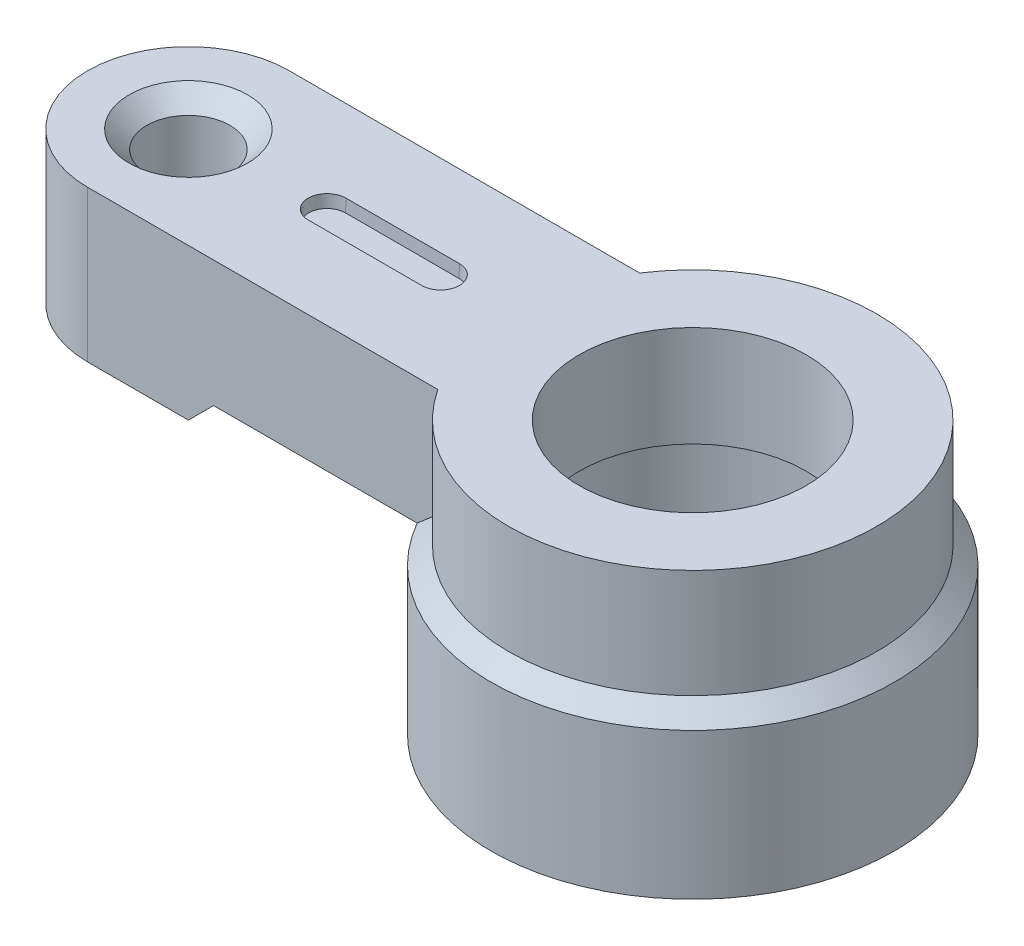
ISO-10303-21;
HEADER;
FILE_DESCRIPTION(('STEP AP214'),'2;1');
FILE_NAME('part.step','',(''),(''),'','','');
FILE_SCHEMA(('AUTOMOTIVE_DESIGN { 1 0 10303 214 1 1 1 1 }'));
ENDSEC;
DATA;
#1=APPLICATION_CONTEXT('core data for automotive mechanical design processes');
#2=APPLICATION_PROTOCOL_DEFINITION('international standard','automotive_design',2000,#1);
#3=PRODUCT_CONTEXT('',#1,'mechanical');
#4=PRODUCT('Part','Part','',(#3));
#5=PRODUCT_RELATED_PRODUCT_CATEGORY('part','',(#4));
#6=PRODUCT_DEFINITION_FORMATION('','',#4);
#7=PRODUCT_DEFINITION_CONTEXT('part definition',#1,'design');
#8=PRODUCT_DEFINITION('design','',#6,#7);
#9=PRODUCT_DEFINITION_SHAPE('','',#8);
#10=(LENGTH_UNIT() NAMED_UNIT(*) SI_UNIT(.MILLI.,.METRE.));
#11=(NAMED_UNIT(*) PLANE_ANGLE_UNIT() SI_UNIT($,.RADIAN.));
#12=(NAMED_UNIT(*) SI_UNIT($,.STERADIAN.) SOLID_ANGLE_UNIT());
#13=UNCERTAINTY_MEASURE_WITH_UNIT(LENGTH_MEASURE(1.E-05),#10,'distance_accuracy_value','');
#14=(GEOMETRIC_REPRESENTATION_CONTEXT(3) GLOBAL_UNCERTAINTY_ASSIGNED_CONTEXT((#13)) GLOBAL_UNIT_ASSIGNED_CONTEXT((#10,
#11,#12)) REPRESENTATION_CONTEXT('',''));
#15=CARTESIAN_POINT('',(0.,0.,0.));
#16=DIRECTION('',(0.,0.,1.));
#17=DIRECTION('',(1.,0.,0.));
#18=AXIS2_PLACEMENT_3D('',#15,#16,#17);
#19=CARTESIAN_POINT('',(0.,10.8,0.));
#20=DIRECTION('',(0.,1.,0.));
#21=DIRECTION('',(0.,0.,1.));
#22=AXIS2_PLACEMENT_3D('',#19,#20,#21);
#23=PLANE('',#22);
#24=CARTESIAN_POINT('',(-20.,10.8,0.));
#25=DIRECTION('',(0.,-1.,0.));
#26=DIRECTION('',(0.,0.,-1.));
#27=AXIS2_PLACEMENT_3D('',#24,#25,#26);
#28=CIRCLE('',#27,2.35);
#29=CARTESIAN_POINT('',(-20.,10.8,-2.35));
#30=VERTEX_POINT('',#29);
#31=EDGE_CURVE('E306',#30,#30,#28,.T.);
#32=ORIENTED_EDGE('',*,*,#31,.F.);
#33=EDGE_LOOP('',(#32));
#34=FACE_BOUND('',#33,.T.);
#35=DIRECTION('',(-1.,0.,0.));
#36=VECTOR('',#35,1.);
#37=CARTESIAN_POINT('',(-6.10655385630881,10.8,-4.));
#38=LINE('',#37,#36);
#39=CARTESIAN_POINT('',(-16.,10.8,-4.));
#40=VERTEX_POINT('',#39);
#41=CARTESIAN_POINT('',(-20.,10.8,-4.));
#42=VERTEX_POINT('',#41);
#43=EDGE_CURVE('E224',#40,#42,#38,.T.);
#44=ORIENTED_EDGE('',*,*,#43,.F.);
#45=DIRECTION('',(0.,0.,1.));
#46=VECTOR('',#45,1.);
#47=CARTESIAN_POINT('',(-16.,10.8,-8.));
#48=LINE('',#47,#46);
#49=CARTESIAN_POINT('',(-16.,10.8,4.));
#50=VERTEX_POINT('',#49);
#51=EDGE_CURVE('E222',#40,#50,#48,.T.);
#52=ORIENTED_EDGE('',*,*,#51,.T.);
#53=DIRECTION('',(1.,0.,0.));
#54=VECTOR('',#53,1.);
#55=CARTESIAN_POINT('',(-6.10655385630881,10.8,4.));
#56=LINE('',#55,#54);
#57=CARTESIAN_POINT('',(-20.,10.8,4.));
#58=VERTEX_POINT('',#57);
#59=EDGE_CURVE('E233',#58,#50,#56,.T.);
#60=ORIENTED_EDGE('',*,*,#59,.F.);
#61=CARTESIAN_POINT('',(-20.,10.8,0.));
#62=DIRECTION('',(0.,1.,0.));
#63=DIRECTION('',(0.,0.,1.));
#64=AXIS2_PLACEMENT_3D('',#61,#62,#63);
#65=CIRCLE('',#64,4.);
#66=EDGE_CURVE('E230',#42,#58,#65,.T.);
#67=ORIENTED_EDGE('',*,*,#66,.F.);
#68=EDGE_LOOP('',(#44,#52,#60,#67));
#69=FACE_BOUND('',#68,.T.);
#70=ADVANCED_FACE('F17',(#34,#69),#23,.F.);
#71=CARTESIAN_POINT('',(7.3,16.8,0.));
#72=DIRECTION('',(0.,1.,0.));
#73=DIRECTION('',(0.,0.,1.));
#74=AXIS2_PLACEMENT_3D('',#71,#72,#73);
#75=PLANE('',#74);
#76=CARTESIAN_POINT('',(-20.,16.8,0.));
#77=DIRECTION('',(0.,-1.,0.));
#78=DIRECTION('',(0.,0.,-1.));
#79=AXIS2_PLACEMENT_3D('',#76,#77,#78);
#80=CIRCLE('',#79,2.35);
#81=CARTESIAN_POINT('',(-20.,16.8,-2.35));
#82=VERTEX_POINT('',#81);
#83=EDGE_CURVE('E289',#82,#82,#80,.T.);
#84=ORIENTED_EDGE('',*,*,#83,.T.);
#85=EDGE_LOOP('',(#84));
#86=FACE_BOUND('',#85,.T.);
#87=CARTESIAN_POINT('',(0.,16.8,0.));
#88=DIRECTION('',(0.,-1.,0.));
#89=DIRECTION('',(0.,0.,-1.));
#90=AXIS2_PLACEMENT_3D('',#87,#88,#89);
#91=CIRCLE('',#90,4.5);
#92=CARTESIAN_POINT('',(0.,16.8,-4.5));
#93=VERTEX_POINT('',#92);
#94=EDGE_CURVE('E254',#93,#93,#91,.T.);
#95=ORIENTED_EDGE('',*,*,#94,.T.);
#96=EDGE_LOOP('',(#95));
#97=FACE_BOUND('',#96,.T.);
#98=CARTESIAN_POINT('',(0.,16.8,0.));
#99=DIRECTION('',(0.,-1.,0.));
#100=DIRECTION('',(0.,0.,-1.));
#101=AXIS2_PLACEMENT_3D('',#98,#99,#100);
#102=CIRCLE('',#101,7.3);
#103=CARTESIAN_POINT('',(-6.10655385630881,16.8,-4.));
#104=VERTEX_POINT('',#103);
#105=CARTESIAN_POINT('',(-6.10655385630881,16.8,4.));
#106=VERTEX_POINT('',#105);
#107=EDGE_CURVE('E133',#104,#106,#102,.T.);
#108=ORIENTED_EDGE('',*,*,#107,.F.);
#109=DIRECTION('',(-1.,0.,0.));
#110=VECTOR('',#109,1.);
#111=CARTESIAN_POINT('',(-6.10655385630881,16.8,-4.));
#112=LINE('',#111,#110);
#113=CARTESIAN_POINT('',(-20.,16.8,-4.));
#114=VERTEX_POINT('',#113);
#115=EDGE_CURVE('E243',#104,#114,#112,.T.);
#116=ORIENTED_EDGE('',*,*,#115,.T.);
#117=CARTESIAN_POINT('',(-20.,16.8,0.));
#118=DIRECTION('',(0.,1.,0.));
#119=DIRECTION('',(0.,0.,1.));
#120=AXIS2_PLACEMENT_3D('',#117,#118,#119);
#121=CIRCLE('',#120,4.);
#122=CARTESIAN_POINT('',(-20.,16.8,4.));
#123=VERTEX_POINT('',#122);
#124=EDGE_CURVE('E236',#114,#123,#121,.T.);
#125=ORIENTED_EDGE('',*,*,#124,.T.);
#126=DIRECTION('',(1.,0.,0.));
#127=VECTOR('',#126,1.);
#128=CARTESIAN_POINT('',(-6.10655385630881,16.8,4.));
#129=LINE('',#128,#127);
#130=EDGE_CURVE('E231',#123,#106,#129,.T.);
#131=ORIENTED_EDGE('',*,*,#130,.T.);
#132=EDGE_LOOP('',(#108,#116,#125,#131));
#133=FACE_BOUND('',#132,.T.);
#134=DIRECTION('',(1.,0.,0.));
#135=VECTOR('',#134,1.);
#136=CARTESIAN_POINT('',(-10.,16.8,-0.75));
#137=LINE('',#136,#135);
#138=CARTESIAN_POINT('',(-14.5,16.8,-0.75));
#139=VERTEX_POINT('',#138);
#140=CARTESIAN_POINT('',(-10.,16.8,-0.75));
#141=VERTEX_POINT('',#140);
#142=EDGE_CURVE('E283',#139,#141,#137,.T.);
#143=ORIENTED_EDGE('',*,*,#142,.T.);
#144=CARTESIAN_POINT('',(-10.,16.8,0.));
#145=DIRECTION('',(0.,-1.,0.));
#146=DIRECTION('',(0.,0.,-1.));
#147=AXIS2_PLACEMENT_3D('',#144,#145,#146);
#148=CIRCLE('',#147,0.75);
#149=CARTESIAN_POINT('',(-10.,16.8,0.75));
#150=VERTEX_POINT('',#149);
#151=EDGE_CURVE('E32',#141,#150,#148,.T.);
#152=ORIENTED_EDGE('',*,*,#151,.T.);
#153=DIRECTION('',(-1.,0.,0.));
#154=VECTOR('',#153,1.);
#155=CARTESIAN_POINT('',(-10.,16.8,0.75));
#156=LINE('',#155,#154);
#157=CARTESIAN_POINT('',(-14.5,16.8,0.75));
#158=VERTEX_POINT('',#157);
#159=EDGE_CURVE('E277',#150,#158,#156,.T.);
#160=ORIENTED_EDGE('',*,*,#159,.T.);
#161=CARTESIAN_POINT('',(-14.5,16.8,0.));
#162=DIRECTION('',(0.,-1.,0.));
#163=DIRECTION('',(0.,0.,-1.));
#164=AXIS2_PLACEMENT_3D('',#161,#162,#163);
#165=CIRCLE('',#164,0.75);
#166=EDGE_CURVE('E280',#158,#139,#165,.T.);
#167=ORIENTED_EDGE('',*,*,#166,.T.);
#168=EDGE_LOOP('',(#143,#152,#160,#167));
#169=FACE_BOUND('',#168,.T.);
#170=ADVANCED_FACE('F19',(#86,#97,#133,#169),#75,.T.);
#171=CARTESIAN_POINT('',(0.,6.,0.));
#172=DIRECTION('',(0.,-1.,0.));
#173=DIRECTION('',(0.,0.,-1.));
#174=AXIS2_PLACEMENT_3D('',#171,#172,#173);
#175=CYLINDRICAL_SURFACE('',#174,4.5);
#176=CARTESIAN_POINT('',(0.,12.8,0.));
#177=DIRECTION('',(0.,-1.,0.));
#178=DIRECTION('',(0.,0.,-1.));
#179=AXIS2_PLACEMENT_3D('',#176,#177,#178);
#180=CIRCLE('',#179,4.5);
#181=CARTESIAN_POINT('',(0.,12.8,-4.5));
#182=VERTEX_POINT('',#181);
#183=EDGE_CURVE('E259',#182,#182,#180,.T.);
#184=ORIENTED_EDGE('',*,*,#183,.T.);
#185=EDGE_LOOP('',(#184));
#186=FACE_BOUND('',#185,.T.);
#187=ORIENTED_EDGE('',*,*,#94,.F.);
#188=EDGE_LOOP('',(#187));
#189=FACE_BOUND('',#188,.T.);
#190=ADVANCED_FACE('F176',(#186,#189),#175,.F.);
#191=CARTESIAN_POINT('',(4.5,12.8,0.));
#192=DIRECTION('',(0.,-1.,0.));
#193=DIRECTION('',(0.,0.,-1.));
#194=AXIS2_PLACEMENT_3D('',#191,#192,#193);
#195=PLANE('',#194);
#196=CARTESIAN_POINT('',(0.,12.8,0.));
#197=DIRECTION('',(0.,-1.,0.));
#198=DIRECTION('',(0.,0.,-1.));
#199=AXIS2_PLACEMENT_3D('',#196,#197,#198);
#200=CIRCLE('',#199,5.15);
#201=CARTESIAN_POINT('',(0.,12.8,-5.15));
#202=VERTEX_POINT('',#201);
#203=EDGE_CURVE('E262',#202,#202,#200,.T.);
#204=ORIENTED_EDGE('',*,*,#203,.T.);
#205=EDGE_LOOP('',(#204));
#206=FACE_BOUND('',#205,.T.);
#207=ORIENTED_EDGE('',*,*,#183,.F.);
#208=EDGE_LOOP('',(#207));
#209=FACE_BOUND('',#208,.T.);
#210=ADVANCED_FACE('F321',(#206,#209),#195,.T.);
#211=CARTESIAN_POINT('',(0.,6.,0.));
#212=DIRECTION('',(0.,-1.,0.));
#213=DIRECTION('',(0.,0.,-1.));
#214=AXIS2_PLACEMENT_3D('',#211,#212,#213);
#215=CYLINDRICAL_SURFACE('',#214,5.15);
#216=CARTESIAN_POINT('',(0.,6.,0.));
#217=DIRECTION('',(0.,-1.,0.));
#218=DIRECTION('',(0.,0.,-1.));
#219=AXIS2_PLACEMENT_3D('',#216,#217,#218);
#220=CIRCLE('',#219,5.15);
#221=CARTESIAN_POINT('',(0.,6.,-5.15));
#222=VERTEX_POINT('',#221);
#223=EDGE_CURVE('E265',#222,#222,#220,.T.);
#224=ORIENTED_EDGE('',*,*,#223,.T.);
#225=EDGE_LOOP('',(#224));
#226=FACE_BOUND('',#225,.T.);
#227=ORIENTED_EDGE('',*,*,#203,.F.);
#228=EDGE_LOOP('',(#227));
#229=FACE_BOUND('',#228,.T.);
#230=ADVANCED_FACE('F327',(#226,#229),#215,.F.);
#231=CARTESIAN_POINT('',(5.15,6.,0.));
#232=DIRECTION('',(0.,-1.,0.));
#233=DIRECTION('',(0.,0.,-1.));
#234=AXIS2_PLACEMENT_3D('',#231,#232,#233);
#235=PLANE('',#234);
#236=CARTESIAN_POINT('',(0.,6.,0.));
#237=DIRECTION('',(0.,-1.,0.));
#238=DIRECTION('',(0.,0.,-1.));
#239=AXIS2_PLACEMENT_3D('',#236,#237,#238);
#240=CIRCLE('',#239,8.);
#241=CARTESIAN_POINT('',(0.,6.,-8.));
#242=VERTEX_POINT('',#241);
#243=EDGE_CURVE('E123',#242,#242,#240,.T.);
#244=ORIENTED_EDGE('',*,*,#243,.T.);
#245=EDGE_LOOP('',(#244));
#246=FACE_BOUND('',#245,.T.);
#247=ORIENTED_EDGE('',*,*,#223,.F.);
#248=EDGE_LOOP('',(#247));
#249=FACE_BOUND('',#248,.T.);
#250=ADVANCED_FACE('F333',(#246,#249),#235,.T.);
#251=CARTESIAN_POINT('',(0.,6.,0.));
#252=DIRECTION('',(0.,-1.,0.));
#253=DIRECTION('',(0.,0.,-1.));
#254=AXIS2_PLACEMENT_3D('',#251,#252,#253);
#255=CYLINDRICAL_SURFACE('',#254,8.);
#256=CARTESIAN_POINT('',(0.,11.8,0.));
#257=DIRECTION('',(0.,-1.,0.));
#258=DIRECTION('',(0.,0.,-1.));
#259=AXIS2_PLACEMENT_3D('',#256,#257,#258);
#260=CIRCLE('',#259,8.);
#261=CARTESIAN_POINT('',(-6.92820323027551,11.8,-4.));
#262=VERTEX_POINT('',#261);
#263=CARTESIAN_POINT('',(-6.92820323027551,11.8,4.));
#264=VERTEX_POINT('',#263);
#265=EDGE_CURVE('E117',#262,#264,#260,.T.);
#266=ORIENTED_EDGE('',*,*,#265,.T.);
#267=CARTESIAN_POINT('',(0.,11.8,0.));
#268=DIRECTION('',(0.,1.,0.));
#269=DIRECTION('',(-1.,0.,0.));
#270=AXIS2_PLACEMENT_3D('',#267,#268,#269);
#271=CIRCLE('',#270,8.);
#272=EDGE_CURVE('E106',#264,#262,#271,.F.);
#273=ORIENTED_EDGE('',*,*,#272,.T.);
#274=EDGE_LOOP('',(#266,#273));
#275=FACE_BOUND('',#274,.T.);
#276=ORIENTED_EDGE('',*,*,#243,.F.);
#277=EDGE_LOOP('',(#276));
#278=FACE_BOUND('',#277,.T.);
#279=ADVANCED_FACE('F115',(#275,#278),#255,.T.);
#280=CARTESIAN_POINT('',(0.,11.8,0.));
#281=DIRECTION('',(0.,-1.,0.));
#282=DIRECTION('',(0.,0.,-1.));
#283=AXIS2_PLACEMENT_3D('',#280,#281,#282);
#284=CONICAL_SURFACE('',#283,8.,0.78539816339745);
#285=CARTESIAN_POINT('',(-9.67322054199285,9.33237392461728,4.));
#286=CARTESIAN_POINT('',(-9.42797457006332,9.55896998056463,4.));
#287=CARTESIAN_POINT('',(-9.18213431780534,9.78492888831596,4.));
#288=CARTESIAN_POINT('',(-8.68890503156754,10.235131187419,4.));
#289=CARTESIAN_POINT('',(-8.44151605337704,10.4593746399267,4.));
#290=CARTESIAN_POINT('',(-7.9451174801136,10.9054462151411,4.));
#291=CARTESIAN_POINT('',(-7.69611025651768,11.1272769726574,4.));
#292=CARTESIAN_POINT('',(-7.19562295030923,11.5681757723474,4.));
#293=CARTESIAN_POINT('',(-6.94414268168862,11.7872436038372,4.));
#294=CARTESIAN_POINT('',(-6.4376579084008,12.2219710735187,4.));
#295=CARTESIAN_POINT('',(-6.18264910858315,12.437625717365,4.));
#296=CARTESIAN_POINT('',(-5.66845146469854,12.8638224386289,4.));
#297=CARTESIAN_POINT('',(-5.40926345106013,13.0743655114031,4.));
#298=CARTESIAN_POINT('',(-5.01600401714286,13.3848718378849,4.));
#299=CARTESIAN_POINT('',(-4.88408173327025,13.4875560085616,4.));
#300=CARTESIAN_POINT('',(-4.61854111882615,13.6906952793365,4.));
#301=CARTESIAN_POINT('',(-4.48492288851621,13.7911505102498,4.));
#302=CARTESIAN_POINT('',(-4.21559467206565,13.9894160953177,4.));
#303=CARTESIAN_POINT('',(-4.07988337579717,14.0872246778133,4.));
#304=CARTESIAN_POINT('',(-3.8060375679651,14.2794432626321,4.));
#305=CARTESIAN_POINT('',(-3.66790256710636,14.373852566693,4.));
#306=CARTESIAN_POINT('',(-3.52837489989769,14.4661993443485,4.));
#307=B_SPLINE_CURVE_WITH_KNOTS('',3,(#285,#286,#287,#288,#289,#290,#291,#292,#293,#294,#295,
#296,#297,#298,#299,#300,#301,#302,#303,#304,#305,#306),.UNSPECIFIED.,.F.,.F.,(4,2,2,2,2,2,2,2,
2,2,4),(0.,1.00171470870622,2.00339353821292,3.00383857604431,4.0043594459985,5.00622952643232,
6.00790292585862,6.50940968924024,7.01088694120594,7.51269196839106,8.0145994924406),.UNSPECIFIED.);
#308=CARTESIAN_POINT('',(-6.10655385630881,12.5,4.));
#309=VERTEX_POINT('',#308);
#310=EDGE_CURVE('E122',#264,#309,#307,.T.);
#311=ORIENTED_EDGE('',*,*,#310,.F.);
#312=ORIENTED_EDGE('',*,*,#265,.F.);
#313=CARTESIAN_POINT('',(-3.52837489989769,14.4661993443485,-4.));
#314=CARTESIAN_POINT('',(-3.66790256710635,14.373852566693,-4.));
#315=CARTESIAN_POINT('',(-3.8060375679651,14.2794432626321,-4.));
#316=CARTESIAN_POINT('',(-4.07988337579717,14.0872246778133,-4.));
#317=CARTESIAN_POINT('',(-4.21559467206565,13.9894160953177,-4.));
#318=CARTESIAN_POINT('',(-4.4849228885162,13.7911505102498,-4.));
#319=CARTESIAN_POINT('',(-4.61854111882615,13.6906952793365,-4.));
#320=CARTESIAN_POINT('',(-4.88408173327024,13.4875560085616,-4.));
#321=CARTESIAN_POINT('',(-5.01600401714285,13.3848718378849,-4.));
#322=CARTESIAN_POINT('',(-5.40926345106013,13.0743655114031,-4.));
#323=CARTESIAN_POINT('',(-5.66845146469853,12.8638224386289,-4.));
#324=CARTESIAN_POINT('',(-6.18264910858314,12.437625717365,-4.));
#325=CARTESIAN_POINT('',(-6.4376579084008,12.2219710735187,-4.));
#326=CARTESIAN_POINT('',(-6.94414268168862,11.7872436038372,-4.));
#327=CARTESIAN_POINT('',(-7.19562295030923,11.5681757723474,-4.));
#328=CARTESIAN_POINT('',(-7.69611025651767,11.1272769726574,-4.));
#329=CARTESIAN_POINT('',(-7.94511748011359,10.9054462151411,-4.));
#330=CARTESIAN_POINT('',(-8.44151605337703,10.4593746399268,-4.));
#331=CARTESIAN_POINT('',(-8.68890503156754,10.235131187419,-4.));
#332=CARTESIAN_POINT('',(-9.18213431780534,9.78492888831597,-4.));
#333=CARTESIAN_POINT('',(-9.42797457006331,9.55896998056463,-4.));
#334=CARTESIAN_POINT('',(-9.67322054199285,9.33237392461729,-4.));
#335=B_SPLINE_CURVE_WITH_KNOTS('',3,(#313,#314,#315,#316,#317,#318,#319,#320,#321,#322,#323,
#324,#325,#326,#327,#328,#329,#330,#331,#332,#333,#334),.UNSPECIFIED.,.F.,.F.,(4,2,2,2,2,2,2,2,
2,2,4),(0.,0.501907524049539,1.00371255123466,1.50518980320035,2.00669656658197,
3.00836996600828,4.01024004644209,5.01076091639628,6.01120595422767,7.01288478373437,
8.0145994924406),.UNSPECIFIED.);
#336=CARTESIAN_POINT('',(-6.10655385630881,12.5,-4.));
#337=VERTEX_POINT('',#336);
#338=EDGE_CURVE('E40',#337,#262,#335,.T.);
#339=ORIENTED_EDGE('',*,*,#338,.F.);
#340=CARTESIAN_POINT('',(0.,12.5,0.));
#341=DIRECTION('',(0.,-1.,0.));
#342=DIRECTION('',(0.,0.,-1.));
#343=AXIS2_PLACEMENT_3D('',#340,#341,#342);
#344=CIRCLE('',#343,7.3);
#345=EDGE_CURVE('E124',#337,#309,#344,.T.);
#346=ORIENTED_EDGE('',*,*,#345,.T.);
#347=EDGE_LOOP('',(#311,#312,#339,#346));
#348=FACE_BOUND('',#347,.T.);
#349=ADVANCED_FACE('F120',(#348),#284,.T.);
#350=CARTESIAN_POINT('',(0.,6.,0.));
#351=DIRECTION('',(0.,-1.,0.));
#352=DIRECTION('',(0.,0.,-1.));
#353=AXIS2_PLACEMENT_3D('',#350,#351,#352);
#354=CYLINDRICAL_SURFACE('',#353,7.3);
#355=DIRECTION('',(0.,-1.,0.));
#356=VECTOR('',#355,1.);
#357=CARTESIAN_POINT('',(-6.10655385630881,6.,4.));
#358=LINE('',#357,#356);
#359=EDGE_CURVE('E112',#309,#106,#358,.F.);
#360=ORIENTED_EDGE('',*,*,#359,.F.);
#361=ORIENTED_EDGE('',*,*,#345,.F.);
#362=DIRECTION('',(0.,-1.,0.));
#363=VECTOR('',#362,1.);
#364=CARTESIAN_POINT('',(-6.10655385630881,6.,-4.));
#365=LINE('',#364,#363);
#366=EDGE_CURVE('E130',#104,#337,#365,.T.);
#367=ORIENTED_EDGE('',*,*,#366,.F.);
#368=ORIENTED_EDGE('',*,*,#107,.T.);
#369=EDGE_LOOP('',(#360,#361,#367,#368));
#370=FACE_BOUND('',#369,.T.);
#371=ADVANCED_FACE('F158',(#370),#354,.T.);
#372=CARTESIAN_POINT('',(-6.10655385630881,10.8,4.));
#373=DIRECTION('',(0.,0.,1.));
#374=DIRECTION('',(1.,0.,0.));
#375=AXIS2_PLACEMENT_3D('',#372,#373,#374);
#376=PLANE('',#375);
#377=DIRECTION('',(-1.,0.,0.));
#378=VECTOR('',#377,1.);
#379=CARTESIAN_POINT('',(-15.,11.8,4.));
#380=LINE('',#379,#378);
#381=CARTESIAN_POINT('',(-15.,11.8,4.));
#382=VERTEX_POINT('',#381);
#383=EDGE_CURVE('E118',#264,#382,#380,.T.);
#384=ORIENTED_EDGE('',*,*,#383,.F.);
#385=ORIENTED_EDGE('',*,*,#310,.T.);
#386=ORIENTED_EDGE('',*,*,#359,.T.);
#387=ORIENTED_EDGE('',*,*,#130,.F.);
#388=DIRECTION('',(0.,1.,0.));
#389=VECTOR('',#388,1.);
#390=CARTESIAN_POINT('',(-20.,10.8,4.));
#391=LINE('',#390,#389);
#392=EDGE_CURVE('E131',#58,#123,#391,.T.);
#393=ORIENTED_EDGE('',*,*,#392,.F.);
#394=ORIENTED_EDGE('',*,*,#59,.T.);
#395=DIRECTION('',(-0.707106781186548,-0.707106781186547,0.));
#396=VECTOR('',#395,1.);
#397=CARTESIAN_POINT('',(-16.,10.8,4.));
#398=LINE('',#397,#396);
#399=EDGE_CURVE('E270',#382,#50,#398,.T.);
#400=ORIENTED_EDGE('',*,*,#399,.F.);
#401=EDGE_LOOP('',(#384,#385,#386,#387,#393,#394,#400));
#402=FACE_BOUND('',#401,.T.);
#403=ADVANCED_FACE('F160',(#402),#376,.T.);
#404=CARTESIAN_POINT('',(-20.,10.8,0.));
#405=DIRECTION('',(0.,1.,0.));
#406=DIRECTION('',(0.,0.,1.));
#407=AXIS2_PLACEMENT_3D('',#404,#405,#406);
#408=CYLINDRICAL_SURFACE('',#407,4.);
#409=ORIENTED_EDGE('',*,*,#124,.F.);
#410=DIRECTION('',(0.,1.,0.));
#411=VECTOR('',#410,1.);
#412=CARTESIAN_POINT('',(-20.,10.8,-4.));
#413=LINE('',#412,#411);
#414=EDGE_CURVE('E135',#42,#114,#413,.T.);
#415=ORIENTED_EDGE('',*,*,#414,.F.);
#416=ORIENTED_EDGE('',*,*,#66,.T.);
#417=ORIENTED_EDGE('',*,*,#392,.T.);
#418=EDGE_LOOP('',(#409,#415,#416,#417));
#419=FACE_BOUND('',#418,.T.);
#420=ADVANCED_FACE('F157',(#419),#408,.T.);
#421=CARTESIAN_POINT('',(-6.10655385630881,10.8,-4.));
#422=DIRECTION('',(0.,0.,-1.));
#423=DIRECTION('',(-1.,0.,0.));
#424=AXIS2_PLACEMENT_3D('',#421,#422,#423);
#425=PLANE('',#424);
#426=ORIENTED_EDGE('',*,*,#338,.T.);
#427=DIRECTION('',(1.,0.,0.));
#428=VECTOR('',#427,1.);
#429=CARTESIAN_POINT('',(-6.10655385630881,11.8,-4.));
#430=LINE('',#429,#428);
#431=CARTESIAN_POINT('',(-15.,11.8,-4.));
#432=VERTEX_POINT('',#431);
#433=EDGE_CURVE('E25',#432,#262,#430,.T.);
#434=ORIENTED_EDGE('',*,*,#433,.F.);
#435=DIRECTION('',(0.707106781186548,0.707106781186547,0.));
#436=VECTOR('',#435,1.);
#437=CARTESIAN_POINT('',(-11.0532769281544,15.7467230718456,-4.));
#438=LINE('',#437,#436);
#439=EDGE_CURVE('E11',#40,#432,#438,.T.);
#440=ORIENTED_EDGE('',*,*,#439,.F.);
#441=ORIENTED_EDGE('',*,*,#43,.T.);
#442=ORIENTED_EDGE('',*,*,#414,.T.);
#443=ORIENTED_EDGE('',*,*,#115,.F.);
#444=ORIENTED_EDGE('',*,*,#366,.T.);
#445=EDGE_LOOP('',(#426,#434,#440,#441,#442,#443,#444));
#446=FACE_BOUND('',#445,.T.);
#447=ADVANCED_FACE('F127',(#446),#425,.T.);
#448=CARTESIAN_POINT('',(-20.,16.1,0.));
#449=DIRECTION('',(0.,1.,0.));
#450=DIRECTION('',(0.,0.,1.));
#451=AXIS2_PLACEMENT_3D('',#448,#449,#450);
#452=CONICAL_SURFACE('',#451,1.65,0.785398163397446);
#453=ORIENTED_EDGE('',*,*,#83,.F.);
#454=EDGE_LOOP('',(#453));
#455=FACE_BOUND('',#454,.T.);
#456=CARTESIAN_POINT('',(-20.,16.1,0.));
#457=DIRECTION('',(0.,-1.,0.));
#458=DIRECTION('',(0.,0.,-1.));
#459=AXIS2_PLACEMENT_3D('',#456,#457,#458);
#460=CIRCLE('',#459,1.65);
#461=CARTESIAN_POINT('',(-20.,16.1,-1.65));
#462=VERTEX_POINT('',#461);
#463=EDGE_CURVE('E239',#462,#462,#460,.T.);
#464=ORIENTED_EDGE('',*,*,#463,.T.);
#465=EDGE_LOOP('',(#464));
#466=FACE_BOUND('',#465,.T.);
#467=ADVANCED_FACE('F156',(#455,#466),#452,.F.);
#468=CARTESIAN_POINT('',(-20.,10.8,0.));
#469=DIRECTION('',(0.,-1.,0.));
#470=DIRECTION('',(0.,0.,-1.));
#471=AXIS2_PLACEMENT_3D('',#468,#469,#470);
#472=CYLINDRICAL_SURFACE('',#471,1.65);
#473=ORIENTED_EDGE('',*,*,#463,.F.);
#474=EDGE_LOOP('',(#473));
#475=FACE_BOUND('',#474,.T.);
#476=CARTESIAN_POINT('',(-20.,11.5,0.));
#477=DIRECTION('',(0.,-1.,0.));
#478=DIRECTION('',(0.,0.,-1.));
#479=AXIS2_PLACEMENT_3D('',#476,#477,#478);
#480=CIRCLE('',#479,1.65);
#481=CARTESIAN_POINT('',(-20.,11.5,-1.65));
#482=VERTEX_POINT('',#481);
#483=EDGE_CURVE('E308',#482,#482,#480,.T.);
#484=ORIENTED_EDGE('',*,*,#483,.T.);
#485=EDGE_LOOP('',(#484));
#486=FACE_BOUND('',#485,.T.);
#487=ADVANCED_FACE('F184',(#475,#486),#472,.F.);
#488=CARTESIAN_POINT('',(-20.,10.8,0.));
#489=DIRECTION('',(0.,-1.,0.));
#490=DIRECTION('',(0.,0.,-1.));
#491=AXIS2_PLACEMENT_3D('',#488,#489,#490);
#492=CONICAL_SURFACE('',#491,2.35,0.785398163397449);
#493=ORIENTED_EDGE('',*,*,#483,.F.);
#494=EDGE_LOOP('',(#493));
#495=FACE_BOUND('',#494,.T.);
#496=ORIENTED_EDGE('',*,*,#31,.T.);
#497=EDGE_LOOP('',(#496));
#498=FACE_BOUND('',#497,.T.);
#499=ADVANCED_FACE('F188',(#495,#498),#492,.F.);
#500=CARTESIAN_POINT('',(-10.,16.8,0.));
#501=DIRECTION('',(0.,1.,0.));
#502=DIRECTION('',(0.,0.,-1.));
#503=AXIS2_PLACEMENT_3D('',#500,#501,#502);
#504=CONICAL_SURFACE('',#503,0.75,0.0349065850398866);
#505=ORIENTED_EDGE('',*,*,#151,.F.);
#506=DIRECTION('',(0.,0.999390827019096,-0.034899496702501));
#507=VECTOR('',#506,1.);
#508=CARTESIAN_POINT('',(-10.,16.8,-0.75));
#509=LINE('',#508,#507);
#510=CARTESIAN_POINT('',(-10.,16.3,-0.732539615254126));
#511=VERTEX_POINT('',#510);
#512=EDGE_CURVE('E291',#511,#141,#509,.T.);
#513=ORIENTED_EDGE('',*,*,#512,.F.);
#514=CARTESIAN_POINT('',(-10.,16.3,0.));
#515=DIRECTION('',(0.,-1.,0.));
#516=DIRECTION('',(0.,0.,-1.));
#517=AXIS2_PLACEMENT_3D('',#514,#515,#516);
#518=CIRCLE('',#517,0.732539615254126);
#519=CARTESIAN_POINT('',(-10.,16.3,0.732539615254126));
#520=VERTEX_POINT('',#519);
#521=EDGE_CURVE('E286',#511,#520,#518,.T.);
#522=ORIENTED_EDGE('',*,*,#521,.T.);
#523=DIRECTION('',(0.,0.999390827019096,0.034899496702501));
#524=VECTOR('',#523,1.);
#525=CARTESIAN_POINT('',(-10.,16.8,0.75));
#526=LINE('',#525,#524);
#527=EDGE_CURVE('E287',#520,#150,#526,.T.);
#528=ORIENTED_EDGE('',*,*,#527,.T.);
#529=EDGE_LOOP('',(#505,#513,#522,#528));
#530=FACE_BOUND('',#529,.T.);
#531=ADVANCED_FACE('F192',(#530),#504,.F.);
#532=CARTESIAN_POINT('',(-10.,16.8,0.75));
#533=DIRECTION('',(0.,-0.034899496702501,0.999390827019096));
#534=DIRECTION('',(0.,-0.999390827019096,-0.034899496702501));
#535=AXIS2_PLACEMENT_3D('',#532,#533,#534);
#536=PLANE('',#535);
#537=ORIENTED_EDGE('',*,*,#159,.F.);
#538=ORIENTED_EDGE('',*,*,#527,.F.);
#539=DIRECTION('',(1.,0.,0.));
#540=VECTOR('',#539,1.);
#541=CARTESIAN_POINT('',(-10.,16.3,0.732539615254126));
#542=LINE('',#541,#540);
#543=CARTESIAN_POINT('',(-14.5,16.3,0.732539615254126));
#544=VERTEX_POINT('',#543);
#545=EDGE_CURVE('E299',#520,#544,#542,.F.);
#546=ORIENTED_EDGE('',*,*,#545,.T.);
#547=DIRECTION('',(0.,0.999390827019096,0.034899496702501));
#548=VECTOR('',#547,1.);
#549=CARTESIAN_POINT('',(-14.5,16.8,0.75));
#550=LINE('',#549,#548);
#551=EDGE_CURVE('E290',#544,#158,#550,.T.);
#552=ORIENTED_EDGE('',*,*,#551,.T.);
#553=EDGE_LOOP('',(#537,#538,#546,#552));
#554=FACE_BOUND('',#553,.T.);
#555=ADVANCED_FACE('F194',(#554),#536,.F.);
#556=CARTESIAN_POINT('',(-14.5,16.8,0.));
#557=DIRECTION('',(0.,1.,0.));
#558=DIRECTION('',(0.,0.,-1.));
#559=AXIS2_PLACEMENT_3D('',#556,#557,#558);
#560=CONICAL_SURFACE('',#559,0.75,0.0349065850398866);
#561=ORIENTED_EDGE('',*,*,#166,.F.);
#562=ORIENTED_EDGE('',*,*,#551,.F.);
#563=CARTESIAN_POINT('',(-14.5,16.3,0.));
#564=DIRECTION('',(0.,-1.,0.));
#565=DIRECTION('',(0.,0.,-1.));
#566=AXIS2_PLACEMENT_3D('',#563,#564,#565);
#567=CIRCLE('',#566,0.732539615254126);
#568=CARTESIAN_POINT('',(-14.5,16.3,-0.732539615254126));
#569=VERTEX_POINT('',#568);
#570=EDGE_CURVE('E301',#544,#569,#567,.T.);
#571=ORIENTED_EDGE('',*,*,#570,.T.);
#572=DIRECTION('',(0.,0.999390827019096,-0.034899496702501));
#573=VECTOR('',#572,1.);
#574=CARTESIAN_POINT('',(-14.5,16.8,-0.75));
#575=LINE('',#574,#573);
#576=EDGE_CURVE('E293',#569,#139,#575,.T.);
#577=ORIENTED_EDGE('',*,*,#576,.T.);
#578=EDGE_LOOP('',(#561,#562,#571,#577));
#579=FACE_BOUND('',#578,.T.);
#580=ADVANCED_FACE('F197',(#579),#560,.F.);
#581=CARTESIAN_POINT('',(-10.,16.8,-0.75));
#582=DIRECTION('',(0.,-0.034899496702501,-0.999390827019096));
#583=DIRECTION('',(0.,0.999390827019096,-0.034899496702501));
#584=AXIS2_PLACEMENT_3D('',#581,#582,#583);
#585=PLANE('',#584);
#586=ORIENTED_EDGE('',*,*,#142,.F.);
#587=ORIENTED_EDGE('',*,*,#576,.F.);
#588=DIRECTION('',(-1.,0.,0.));
#589=VECTOR('',#588,1.);
#590=CARTESIAN_POINT('',(-10.,16.3,-0.732539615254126));
#591=LINE('',#590,#589);
#592=EDGE_CURVE('E294',#569,#511,#591,.F.);
#593=ORIENTED_EDGE('',*,*,#592,.T.);
#594=ORIENTED_EDGE('',*,*,#512,.T.);
#595=EDGE_LOOP('',(#586,#587,#593,#594));
#596=FACE_BOUND('',#595,.T.);
#597=ADVANCED_FACE('F201',(#596),#585,.F.);
#598=CARTESIAN_POINT('',(-10.,16.3,0.));
#599=DIRECTION('',(0.,-1.,0.));
#600=DIRECTION('',(0.,0.,-1.));
#601=AXIS2_PLACEMENT_3D('',#598,#599,#600);
#602=PLANE('',#601);
#603=ORIENTED_EDGE('',*,*,#521,.F.);
#604=ORIENTED_EDGE('',*,*,#592,.F.);
#605=ORIENTED_EDGE('',*,*,#570,.F.);
#606=ORIENTED_EDGE('',*,*,#545,.F.);
#607=EDGE_LOOP('',(#603,#604,#605,#606));
#608=FACE_BOUND('',#607,.T.);
#609=ADVANCED_FACE('F205',(#608),#602,.F.);
#610=CARTESIAN_POINT('',(-16.,10.8,-8.));
#611=DIRECTION('',(-0.707106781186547,0.707106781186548,0.));
#612=DIRECTION('',(-0.707106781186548,-0.707106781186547,0.));
#613=AXIS2_PLACEMENT_3D('',#610,#611,#612);
#614=PLANE('',#613);
#615=ORIENTED_EDGE('',*,*,#439,.T.);
#616=DIRECTION('',(0.,0.,1.));
#617=VECTOR('',#616,1.);
#618=CARTESIAN_POINT('',(-15.,11.8,-8.));
#619=LINE('',#618,#617);
#620=EDGE_CURVE('E109',#432,#382,#619,.T.);
#621=ORIENTED_EDGE('',*,*,#620,.T.);
#622=ORIENTED_EDGE('',*,*,#399,.T.);
#623=ORIENTED_EDGE('',*,*,#51,.F.);
#624=EDGE_LOOP('',(#615,#621,#622,#623));
#625=FACE_BOUND('',#624,.T.);
#626=ADVANCED_FACE('F211',(#625),#614,.F.);
#627=CARTESIAN_POINT('',(-15.,11.8,-8.));
#628=DIRECTION('',(0.,1.,0.));
#629=DIRECTION('',(-1.,0.,0.));
#630=AXIS2_PLACEMENT_3D('',#627,#628,#629);
#631=PLANE('',#630);
#632=ORIENTED_EDGE('',*,*,#433,.T.);
#633=ORIENTED_EDGE('',*,*,#272,.F.);
#634=ORIENTED_EDGE('',*,*,#383,.T.);
#635=ORIENTED_EDGE('',*,*,#620,.F.);
#636=EDGE_LOOP('',(#632,#633,#634,#635));
#637=FACE_BOUND('',#636,.T.);
#638=ADVANCED_FACE('F105',(#637),#631,.F.);
#639=CLOSED_SHELL('',(#70,#170,#190,#210,#230,#250,#279,#349,#371,#403,#420,#447,#467,#487,#499,
#531,#555,#580,#597,#609,#626,#638));
#640=MANIFOLD_SOLID_BREP('B1',#639);
#641=ADVANCED_BREP_SHAPE_REPRESENTATION('',(#18,#640),#14);
#642=SHAPE_DEFINITION_REPRESENTATION(#9,#641);
ENDSEC;
END-ISO-10303-21;
